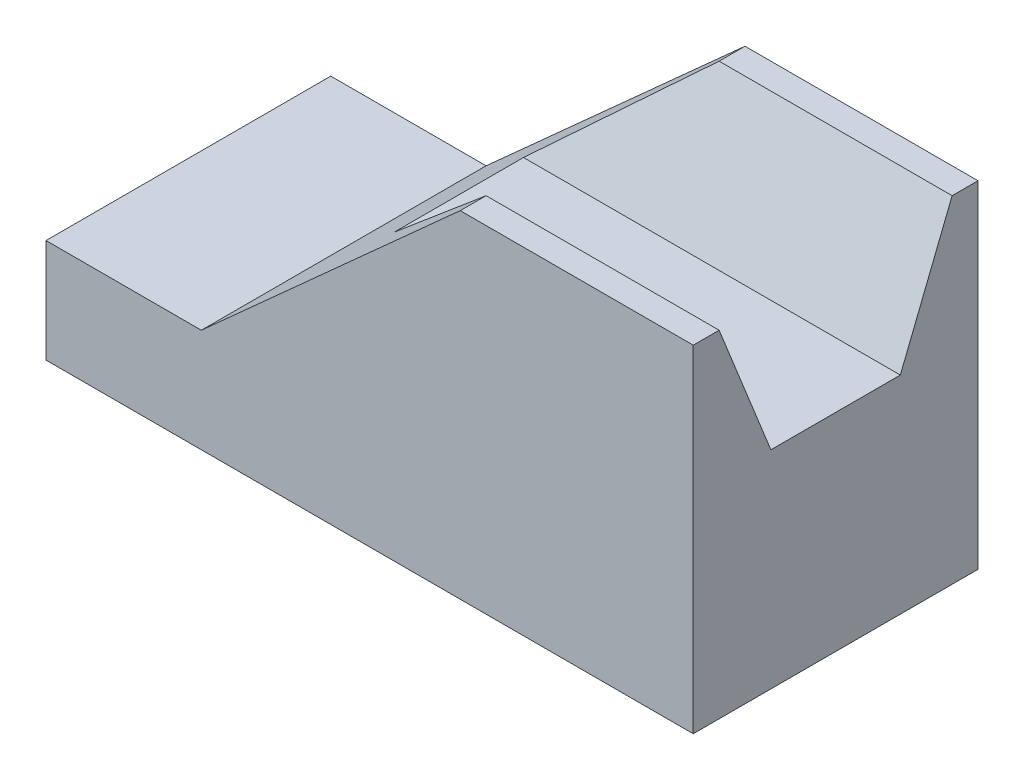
from build123d import *

# Parameters (mm, degrees)
EXTRUDE_1_DEPTH     = 11
CUT_EXTRUDE_1_DEPTH = 58.41950888


with BuildPart() as part:
    # Sketch 1 → Extrude 1 (new, symmetric)
    with BuildSketch(Plane.XY):
        Polygon((0, 0), (50, 0), (50, 26), (32, 26), (12, 8), (0, 8), align=None)
    extrude(amount=EXTRUDE_1_DEPTH, both=True)

    # Sketch 2 → Cut-Extrude 1 (cut, through all)
    with BuildSketch(Plane(origin=(50, 0, 0), x_dir=(0, 0, -1), z_dir=(1, 0, 0))):
        Polygon((9, 26), (5, 16), (-5, 16), (-9, 26), align=None)
    extrude(amount=-CUT_EXTRUDE_1_DEPTH, mode=Mode.SUBTRACT)


solid = part.part
